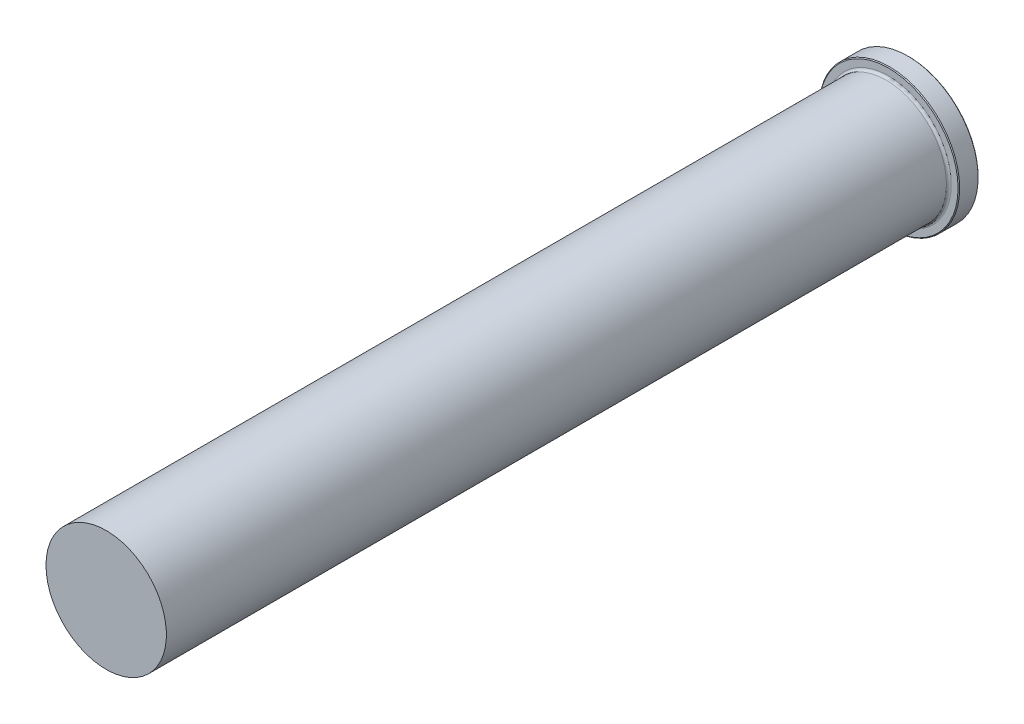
from build123d import *

# Parameters (mm, degrees)
FILLET1_R     = 0.762
CHAMFER1_SIZE = 0.254


with BuildPart() as part:
    # Sketch1 → Revolve1 (revolve)
    with BuildSketch(Plane(origin=(0, 0, 0), x_dir=(0, 0, -1), z_dir=(1, 0, 0)), mode=Mode.PRIVATE) as revolve1_sk:
        Polygon((0, 0), (0, 22.225), (-6.35, 22.225), (-6.35, 19.05), (-254, 19.05), (-254, 0), align=None)
    revolve(revolve1_sk.sketch.rotate(Axis((0, 0, 0), (0, 0, 1)), 90), axis=Axis((0, 0, 0), (0, 0, 1)))

    # Fillet1
    fillet1_edges = [part.edges().sort_by_distance(p)[0] for p in [
        (19.05, 0, 6.35),
    ]]
    fillet(fillet1_edges, radius=FILLET1_R)

    # Chamfer1
    chamfer1_edges = [part.edges().sort_by_distance(p)[0] for p in [
        (22.225, 0, 6.35),
        (22.225, 0, 0),
    ]]
    chamfer(chamfer1_edges, length=CHAMFER1_SIZE)


solid = part.part
